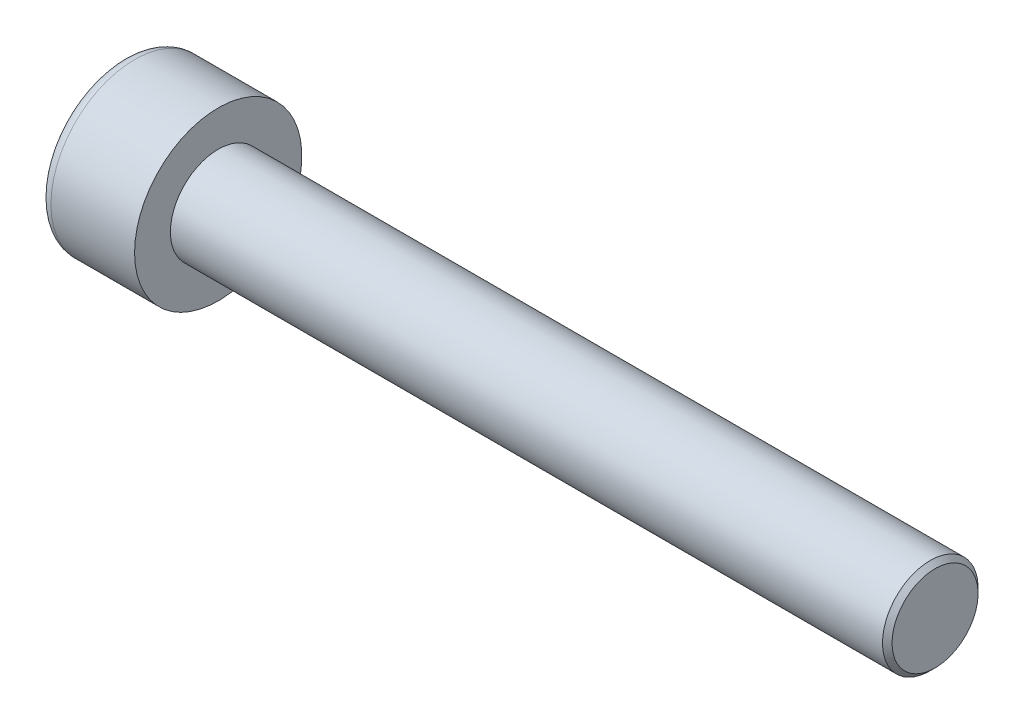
ISO-10303-21;
HEADER;
FILE_DESCRIPTION(('STEP AP214'),'2;1');
FILE_NAME('part.step','',(''),(''),'','','');
FILE_SCHEMA(('AUTOMOTIVE_DESIGN { 1 0 10303 214 1 1 1 1 }'));
ENDSEC;
DATA;
#1=APPLICATION_CONTEXT('core data for automotive mechanical design processes');
#2=APPLICATION_PROTOCOL_DEFINITION('international standard','automotive_design',2000,#1);
#3=PRODUCT_CONTEXT('',#1,'mechanical');
#4=PRODUCT('Part','Part','',(#3));
#5=PRODUCT_RELATED_PRODUCT_CATEGORY('part','',(#4));
#6=PRODUCT_DEFINITION_FORMATION('','',#4);
#7=PRODUCT_DEFINITION_CONTEXT('part definition',#1,'design');
#8=PRODUCT_DEFINITION('design','',#6,#7);
#9=PRODUCT_DEFINITION_SHAPE('','',#8);
#10=(LENGTH_UNIT() NAMED_UNIT(*) SI_UNIT(.MILLI.,.METRE.));
#11=(NAMED_UNIT(*) PLANE_ANGLE_UNIT() SI_UNIT($,.RADIAN.));
#12=(NAMED_UNIT(*) SI_UNIT($,.STERADIAN.) SOLID_ANGLE_UNIT());
#13=UNCERTAINTY_MEASURE_WITH_UNIT(LENGTH_MEASURE(1.E-05),#10,'distance_accuracy_value','');
#14=(GEOMETRIC_REPRESENTATION_CONTEXT(3) GLOBAL_UNCERTAINTY_ASSIGNED_CONTEXT((#13)) GLOBAL_UNIT_ASSIGNED_CONTEXT((#10,
#11,#12)) REPRESENTATION_CONTEXT('',''));
#15=CARTESIAN_POINT('',(0.,0.,0.));
#16=DIRECTION('',(0.,0.,1.));
#17=DIRECTION('',(1.,0.,0.));
#18=AXIS2_PLACEMENT_3D('',#15,#16,#17);
#19=CARTESIAN_POINT('',(2.,0.,-1.73205080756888));
#20=DIRECTION('',(1.,0.,0.));
#21=DIRECTION('',(0.,0.,-1.));
#22=AXIS2_PLACEMENT_3D('',#19,#20,#21);
#23=PLANE('',#22);
#24=DIRECTION('',(0.,0.866025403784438,0.5));
#25=VECTOR('',#24,1.);
#26=CARTESIAN_POINT('',(2.,0.,1.73205080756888));
#27=LINE('',#26,#25);
#28=CARTESIAN_POINT('',(2.,0.,1.73205080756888));
#29=VERTEX_POINT('',#28);
#30=CARTESIAN_POINT('',(2.00000000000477,-0.750000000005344,1.29903810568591));
#31=VERTEX_POINT('',#30);
#32=EDGE_CURVE('E121',#29,#31,#27,.F.);
#33=ORIENTED_EDGE('',*,*,#32,.F.);
#34=DIRECTION('',(0.,0.866025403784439,-0.5));
#35=VECTOR('',#34,1.);
#36=CARTESIAN_POINT('',(2.,1.5,0.866025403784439));
#37=LINE('',#36,#35);
#38=CARTESIAN_POINT('',(2.00000000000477,0.750000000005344,1.29903810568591));
#39=VERTEX_POINT('',#38);
#40=EDGE_CURVE('E120',#39,#29,#37,.F.);
#41=ORIENTED_EDGE('',*,*,#40,.F.);
#42=CARTESIAN_POINT('',(2.00000000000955,0.,0.));
#43=DIRECTION('',(-1.,0.,0.));
#44=DIRECTION('',(0.,0.,1.));
#45=AXIS2_PLACEMENT_3D('',#42,#43,#44);
#46=CIRCLE('',#45,1.50000000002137);
#47=EDGE_CURVE('E95',#39,#31,#46,.F.);
#48=ORIENTED_EDGE('',*,*,#47,.T.);
#49=EDGE_LOOP('',(#33,#41,#48));
#50=FACE_BOUND('',#49,.T.);
#51=ADVANCED_FACE('F17',(#50),#23,.F.);
#52=CARTESIAN_POINT('',(2.,0.,-1.73205080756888));
#53=DIRECTION('',(1.,0.,0.));
#54=DIRECTION('',(0.,0.,-1.));
#55=AXIS2_PLACEMENT_3D('',#52,#53,#54);
#56=PLANE('',#55);
#57=DIRECTION('',(0.,0.866025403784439,-0.5));
#58=VECTOR('',#57,1.);
#59=CARTESIAN_POINT('',(2.,1.5,0.866025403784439));
#60=LINE('',#59,#58);
#61=CARTESIAN_POINT('',(2.,1.5,0.866025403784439));
#62=VERTEX_POINT('',#61);
#63=EDGE_CURVE('E113',#62,#39,#60,.F.);
#64=ORIENTED_EDGE('',*,*,#63,.F.);
#65=DIRECTION('',(0.,0.,-1.));
#66=VECTOR('',#65,1.);
#67=CARTESIAN_POINT('',(2.,1.5,-0.866025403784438));
#68=LINE('',#67,#66);
#69=CARTESIAN_POINT('',(2.00000000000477,1.50000000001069,0.));
#70=VERTEX_POINT('',#69);
#71=EDGE_CURVE('E116',#70,#62,#68,.F.);
#72=ORIENTED_EDGE('',*,*,#71,.F.);
#73=CARTESIAN_POINT('',(2.00000000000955,0.,0.));
#74=DIRECTION('',(-1.,0.,0.));
#75=DIRECTION('',(0.,0.,1.));
#76=AXIS2_PLACEMENT_3D('',#73,#74,#75);
#77=CIRCLE('',#76,1.50000000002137);
#78=EDGE_CURVE('E99',#39,#70,#77,.T.);
#79=ORIENTED_EDGE('',*,*,#78,.F.);
#80=EDGE_LOOP('',(#64,#72,#79));
#81=FACE_BOUND('',#80,.T.);
#82=ADVANCED_FACE('F111',(#81),#56,.F.);
#83=CARTESIAN_POINT('',(2.,1.5,0.866025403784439));
#84=DIRECTION('',(0.,-0.5,-0.866025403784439));
#85=DIRECTION('',(0.,0.866025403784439,-0.5));
#86=AXIS2_PLACEMENT_3D('',#83,#84,#85);
#87=PLANE('',#86);
#88=ORIENTED_EDGE('',*,*,#40,.T.);
#89=DIRECTION('',(1.,0.,0.));
#90=VECTOR('',#89,1.);
#91=CARTESIAN_POINT('',(2.,0.,1.73205080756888));
#92=LINE('',#91,#90);
#93=CARTESIAN_POINT('',(0.,0.,1.73205080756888));
#94=VERTEX_POINT('',#93);
#95=EDGE_CURVE('E140',#94,#29,#92,.T.);
#96=ORIENTED_EDGE('',*,*,#95,.F.);
#97=DIRECTION('',(0.,0.866025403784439,-0.5));
#98=VECTOR('',#97,1.);
#99=CARTESIAN_POINT('',(0.,1.5,0.866025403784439));
#100=LINE('',#99,#98);
#101=CARTESIAN_POINT('',(0.,1.5,0.866025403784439));
#102=VERTEX_POINT('',#101);
#103=EDGE_CURVE('E118',#94,#102,#100,.T.);
#104=ORIENTED_EDGE('',*,*,#103,.T.);
#105=DIRECTION('',(1.,0.,0.));
#106=VECTOR('',#105,1.);
#107=CARTESIAN_POINT('',(2.,1.5,0.866025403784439));
#108=LINE('',#107,#106);
#109=EDGE_CURVE('E130',#62,#102,#108,.F.);
#110=ORIENTED_EDGE('',*,*,#109,.F.);
#111=ORIENTED_EDGE('',*,*,#63,.T.);
#112=EDGE_LOOP('',(#88,#96,#104,#110,#111));
#113=FACE_BOUND('',#112,.T.);
#114=ADVANCED_FACE('F127',(#113),#87,.T.);
#115=CARTESIAN_POINT('',(2.,0.,1.73205080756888));
#116=DIRECTION('',(0.,0.5,-0.866025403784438));
#117=DIRECTION('',(0.,0.866025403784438,0.5));
#118=AXIS2_PLACEMENT_3D('',#115,#116,#117);
#119=PLANE('',#118);
#120=DIRECTION('',(0.,-0.866025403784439,-0.5));
#121=VECTOR('',#120,1.);
#122=CARTESIAN_POINT('',(2.,-0.75,1.29903810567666));
#123=LINE('',#122,#121);
#124=CARTESIAN_POINT('',(2.,-1.5,0.866025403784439));
#125=VERTEX_POINT('',#124);
#126=EDGE_CURVE('E107',#31,#125,#123,.T.);
#127=ORIENTED_EDGE('',*,*,#126,.T.);
#128=DIRECTION('',(1.,0.,0.));
#129=VECTOR('',#128,1.);
#130=CARTESIAN_POINT('',(2.,-1.5,0.866025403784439));
#131=LINE('',#130,#129);
#132=CARTESIAN_POINT('',(0.,-1.5,0.866025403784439));
#133=VERTEX_POINT('',#132);
#134=EDGE_CURVE('E210',#133,#125,#131,.T.);
#135=ORIENTED_EDGE('',*,*,#134,.F.);
#136=DIRECTION('',(0.,0.866025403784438,0.5));
#137=VECTOR('',#136,1.);
#138=CARTESIAN_POINT('',(0.,0.,1.73205080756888));
#139=LINE('',#138,#137);
#140=EDGE_CURVE('E125',#133,#94,#139,.T.);
#141=ORIENTED_EDGE('',*,*,#140,.T.);
#142=ORIENTED_EDGE('',*,*,#95,.T.);
#143=ORIENTED_EDGE('',*,*,#32,.T.);
#144=EDGE_LOOP('',(#127,#135,#141,#142,#143));
#145=FACE_BOUND('',#144,.T.);
#146=ADVANCED_FACE('F428',(#145),#119,.T.);
#147=CARTESIAN_POINT('',(2.,0.,-1.73205080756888));
#148=DIRECTION('',(1.,0.,0.));
#149=DIRECTION('',(0.,0.,-1.));
#150=AXIS2_PLACEMENT_3D('',#147,#148,#149);
#151=PLANE('',#150);
#152=DIRECTION('',(0.,0.,1.));
#153=VECTOR('',#152,1.);
#154=CARTESIAN_POINT('',(2.,-1.5,0.866025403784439));
#155=LINE('',#154,#153);
#156=CARTESIAN_POINT('',(2.00000000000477,-1.50000000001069,0.));
#157=VERTEX_POINT('',#156);
#158=EDGE_CURVE('E207',#125,#157,#155,.F.);
#159=ORIENTED_EDGE('',*,*,#158,.F.);
#160=ORIENTED_EDGE('',*,*,#126,.F.);
#161=CARTESIAN_POINT('',(2.00000000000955,0.,0.));
#162=DIRECTION('',(-1.,0.,0.));
#163=DIRECTION('',(0.,0.,1.));
#164=AXIS2_PLACEMENT_3D('',#161,#162,#163);
#165=CIRCLE('',#164,1.50000000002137);
#166=EDGE_CURVE('E102',#31,#157,#165,.F.);
#167=ORIENTED_EDGE('',*,*,#166,.T.);
#168=EDGE_LOOP('',(#159,#160,#167));
#169=FACE_BOUND('',#168,.T.);
#170=ADVANCED_FACE('F418',(#169),#151,.F.);
#171=CARTESIAN_POINT('',(2.00000000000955,0.,0.));
#172=DIRECTION('',(-1.,0.,0.));
#173=DIRECTION('',(0.,0.,1.));
#174=AXIS2_PLACEMENT_3D('',#171,#172,#173);
#175=CONICAL_SURFACE('',#174,1.50000000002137,1.04719755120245);
#176=CARTESIAN_POINT('',(2.86602540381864,0.,0.));
#177=VERTEX_POINT('',#176);
#178=VERTEX_LOOP('',#177);
#179=FACE_BOUND('',#178,.T.);
#180=CARTESIAN_POINT('',(2.00000000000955,0.,0.));
#181=DIRECTION('',(-1.,0.,0.));
#182=DIRECTION('',(0.,0.,1.));
#183=AXIS2_PLACEMENT_3D('',#180,#181,#182);
#184=CIRCLE('',#183,1.50000000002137);
#185=CARTESIAN_POINT('',(2.00000000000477,0.750000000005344,-1.29903810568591));
#186=VERTEX_POINT('',#185);
#187=EDGE_CURVE('E154',#70,#186,#184,.T.);
#188=ORIENTED_EDGE('',*,*,#187,.T.);
#189=CARTESIAN_POINT('',(2.00000000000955,0.,0.));
#190=DIRECTION('',(-1.,0.,0.));
#191=DIRECTION('',(0.,0.,1.));
#192=AXIS2_PLACEMENT_3D('',#189,#190,#191);
#193=CIRCLE('',#192,1.50000000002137);
#194=CARTESIAN_POINT('',(2.00000000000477,-0.750000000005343,-1.29903810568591));
#195=VERTEX_POINT('',#194);
#196=EDGE_CURVE('E169',#195,#186,#193,.F.);
#197=ORIENTED_EDGE('',*,*,#196,.F.);
#198=CARTESIAN_POINT('',(2.00000000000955,0.,0.));
#199=DIRECTION('',(-1.,0.,0.));
#200=DIRECTION('',(0.,0.,1.));
#201=AXIS2_PLACEMENT_3D('',#198,#199,#200);
#202=CIRCLE('',#201,1.50000000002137);
#203=EDGE_CURVE('E164',#195,#157,#202,.T.);
#204=ORIENTED_EDGE('',*,*,#203,.T.);
#205=ORIENTED_EDGE('',*,*,#166,.F.);
#206=ORIENTED_EDGE('',*,*,#47,.F.);
#207=ORIENTED_EDGE('',*,*,#78,.T.);
#208=EDGE_LOOP('',(#188,#197,#204,#205,#206,#207));
#209=FACE_BOUND('',#208,.T.);
#210=ADVANCED_FACE('F98',(#179,#209),#175,.F.);
#211=CARTESIAN_POINT('',(2.,0.,-1.73205080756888));
#212=DIRECTION('',(1.,0.,0.));
#213=DIRECTION('',(0.,0.,-1.));
#214=AXIS2_PLACEMENT_3D('',#211,#212,#213);
#215=PLANE('',#214);
#216=DIRECTION('',(0.,0.,-1.));
#217=VECTOR('',#216,1.);
#218=CARTESIAN_POINT('',(2.,1.5,-0.866025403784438));
#219=LINE('',#218,#217);
#220=CARTESIAN_POINT('',(2.,1.5,-0.866025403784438));
#221=VERTEX_POINT('',#220);
#222=EDGE_CURVE('E153',#221,#70,#219,.F.);
#223=ORIENTED_EDGE('',*,*,#222,.F.);
#224=DIRECTION('',(0.,-0.866025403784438,-0.5));
#225=VECTOR('',#224,1.);
#226=CARTESIAN_POINT('',(2.,0.,-1.73205080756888));
#227=LINE('',#226,#225);
#228=EDGE_CURVE('E192',#186,#221,#227,.F.);
#229=ORIENTED_EDGE('',*,*,#228,.F.);
#230=ORIENTED_EDGE('',*,*,#187,.F.);
#231=EDGE_LOOP('',(#223,#229,#230));
#232=FACE_BOUND('',#231,.T.);
#233=ADVANCED_FACE('F400',(#232),#215,.F.);
#234=CARTESIAN_POINT('',(2.,1.5,-0.866025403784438));
#235=DIRECTION('',(0.,-1.,0.));
#236=DIRECTION('',(0.,0.,-1.));
#237=AXIS2_PLACEMENT_3D('',#234,#235,#236);
#238=PLANE('',#237);
#239=ORIENTED_EDGE('',*,*,#71,.T.);
#240=ORIENTED_EDGE('',*,*,#109,.T.);
#241=DIRECTION('',(0.,0.,-1.));
#242=VECTOR('',#241,1.);
#243=CARTESIAN_POINT('',(0.,1.5,-0.866025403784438));
#244=LINE('',#243,#242);
#245=CARTESIAN_POINT('',(0.,1.5,-0.866025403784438));
#246=VERTEX_POINT('',#245);
#247=EDGE_CURVE('E150',#102,#246,#244,.T.);
#248=ORIENTED_EDGE('',*,*,#247,.T.);
#249=DIRECTION('',(1.,0.,0.));
#250=VECTOR('',#249,1.);
#251=CARTESIAN_POINT('',(2.,1.5,-0.866025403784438));
#252=LINE('',#251,#250);
#253=EDGE_CURVE('E195',#221,#246,#252,.F.);
#254=ORIENTED_EDGE('',*,*,#253,.F.);
#255=ORIENTED_EDGE('',*,*,#222,.T.);
#256=EDGE_LOOP('',(#239,#240,#248,#254,#255));
#257=FACE_BOUND('',#256,.T.);
#258=ADVANCED_FACE('F391',(#257),#238,.T.);
#259=CARTESIAN_POINT('',(2.,-1.5,0.866025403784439));
#260=DIRECTION('',(0.,1.,0.));
#261=DIRECTION('',(0.,0.,1.));
#262=AXIS2_PLACEMENT_3D('',#259,#260,#261);
#263=PLANE('',#262);
#264=DIRECTION('',(0.,0.,-1.));
#265=VECTOR('',#264,1.);
#266=CARTESIAN_POINT('',(2.,-1.5,-1.73205080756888));
#267=LINE('',#266,#265);
#268=CARTESIAN_POINT('',(2.,-1.5,-0.866025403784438));
#269=VERTEX_POINT('',#268);
#270=EDGE_CURVE('E167',#157,#269,#267,.T.);
#271=ORIENTED_EDGE('',*,*,#270,.T.);
#272=DIRECTION('',(1.,0.,0.));
#273=VECTOR('',#272,1.);
#274=CARTESIAN_POINT('',(2.,-1.5,-0.866025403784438));
#275=LINE('',#274,#273);
#276=CARTESIAN_POINT('',(0.,-1.5,-0.866025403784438));
#277=VERTEX_POINT('',#276);
#278=EDGE_CURVE('E201',#277,#269,#275,.T.);
#279=ORIENTED_EDGE('',*,*,#278,.F.);
#280=DIRECTION('',(0.,0.,1.));
#281=VECTOR('',#280,1.);
#282=CARTESIAN_POINT('',(0.,-1.5,0.866025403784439));
#283=LINE('',#282,#281);
#284=EDGE_CURVE('E218',#277,#133,#283,.T.);
#285=ORIENTED_EDGE('',*,*,#284,.T.);
#286=ORIENTED_EDGE('',*,*,#134,.T.);
#287=ORIENTED_EDGE('',*,*,#158,.T.);
#288=EDGE_LOOP('',(#271,#279,#285,#286,#287));
#289=FACE_BOUND('',#288,.T.);
#290=ADVANCED_FACE('F381',(#289),#263,.T.);
#291=CARTESIAN_POINT('',(2.,0.,-1.73205080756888));
#292=DIRECTION('',(1.,0.,0.));
#293=DIRECTION('',(0.,0.,-1.));
#294=AXIS2_PLACEMENT_3D('',#291,#292,#293);
#295=PLANE('',#294);
#296=DIRECTION('',(0.,-0.866025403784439,0.5));
#297=VECTOR('',#296,1.);
#298=CARTESIAN_POINT('',(2.,-1.5,-0.866025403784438));
#299=LINE('',#298,#297);
#300=EDGE_CURVE('E235',#269,#195,#299,.F.);
#301=ORIENTED_EDGE('',*,*,#300,.F.);
#302=ORIENTED_EDGE('',*,*,#270,.F.);
#303=ORIENTED_EDGE('',*,*,#203,.F.);
#304=EDGE_LOOP('',(#301,#302,#303));
#305=FACE_BOUND('',#304,.T.);
#306=ADVANCED_FACE('F371',(#305),#295,.F.);
#307=CARTESIAN_POINT('',(2.,0.,-1.73205080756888));
#308=DIRECTION('',(1.,0.,0.));
#309=DIRECTION('',(0.,0.,-1.));
#310=AXIS2_PLACEMENT_3D('',#307,#308,#309);
#311=PLANE('',#310);
#312=DIRECTION('',(0.,-0.866025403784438,-0.5));
#313=VECTOR('',#312,1.);
#314=CARTESIAN_POINT('',(2.,0.,-1.73205080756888));
#315=LINE('',#314,#313);
#316=CARTESIAN_POINT('',(2.,0.,-1.73205080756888));
#317=VERTEX_POINT('',#316);
#318=EDGE_CURVE('E196',#317,#186,#315,.F.);
#319=ORIENTED_EDGE('',*,*,#318,.F.);
#320=DIRECTION('',(0.,-0.866025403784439,0.5));
#321=VECTOR('',#320,1.);
#322=CARTESIAN_POINT('',(2.,-1.5,-0.866025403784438));
#323=LINE('',#322,#321);
#324=EDGE_CURVE('E184',#195,#317,#323,.F.);
#325=ORIENTED_EDGE('',*,*,#324,.F.);
#326=ORIENTED_EDGE('',*,*,#196,.T.);
#327=EDGE_LOOP('',(#319,#325,#326));
#328=FACE_BOUND('',#327,.T.);
#329=ADVANCED_FACE('F361',(#328),#311,.F.);
#330=CARTESIAN_POINT('',(2.,0.,-1.73205080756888));
#331=DIRECTION('',(0.,-0.5,0.866025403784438));
#332=DIRECTION('',(0.,-0.866025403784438,-0.5));
#333=AXIS2_PLACEMENT_3D('',#330,#331,#332);
#334=PLANE('',#333);
#335=ORIENTED_EDGE('',*,*,#228,.T.);
#336=ORIENTED_EDGE('',*,*,#253,.T.);
#337=DIRECTION('',(0.,-0.866025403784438,-0.5));
#338=VECTOR('',#337,1.);
#339=CARTESIAN_POINT('',(0.,0.,-1.73205080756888));
#340=LINE('',#339,#338);
#341=CARTESIAN_POINT('',(0.,0.,-1.73205080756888));
#342=VERTEX_POINT('',#341);
#343=EDGE_CURVE('E166',#246,#342,#340,.T.);
#344=ORIENTED_EDGE('',*,*,#343,.T.);
#345=DIRECTION('',(1.,0.,0.));
#346=VECTOR('',#345,1.);
#347=CARTESIAN_POINT('',(2.,0.,-1.73205080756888));
#348=LINE('',#347,#346);
#349=EDGE_CURVE('E178',#317,#342,#348,.F.);
#350=ORIENTED_EDGE('',*,*,#349,.F.);
#351=ORIENTED_EDGE('',*,*,#318,.T.);
#352=EDGE_LOOP('',(#335,#336,#344,#350,#351));
#353=FACE_BOUND('',#352,.T.);
#354=ADVANCED_FACE('F301',(#353),#334,.T.);
#355=CARTESIAN_POINT('',(2.,-1.5,-0.866025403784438));
#356=DIRECTION('',(0.,0.5,0.866025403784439));
#357=DIRECTION('',(0.,-0.866025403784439,0.5));
#358=AXIS2_PLACEMENT_3D('',#355,#356,#357);
#359=PLANE('',#358);
#360=ORIENTED_EDGE('',*,*,#324,.T.);
#361=ORIENTED_EDGE('',*,*,#349,.T.);
#362=DIRECTION('',(0.,-0.866025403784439,0.5));
#363=VECTOR('',#362,1.);
#364=CARTESIAN_POINT('',(0.,0.,-1.73205080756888));
#365=LINE('',#364,#363);
#366=EDGE_CURVE('E176',#342,#277,#365,.T.);
#367=ORIENTED_EDGE('',*,*,#366,.T.);
#368=ORIENTED_EDGE('',*,*,#278,.T.);
#369=ORIENTED_EDGE('',*,*,#300,.T.);
#370=EDGE_LOOP('',(#360,#361,#367,#368,#369));
#371=FACE_BOUND('',#370,.T.);
#372=ADVANCED_FACE('F295',(#371),#359,.T.);
#373=CARTESIAN_POINT('',(0.,0.,0.));
#374=DIRECTION('',(1.,0.,0.));
#375=DIRECTION('',(0.,0.,-1.));
#376=AXIS2_PLACEMENT_3D('',#373,#374,#375);
#377=PLANE('',#376);
#378=ORIENTED_EDGE('',*,*,#343,.F.);
#379=ORIENTED_EDGE('',*,*,#247,.F.);
#380=ORIENTED_EDGE('',*,*,#103,.F.);
#381=ORIENTED_EDGE('',*,*,#140,.F.);
#382=ORIENTED_EDGE('',*,*,#284,.F.);
#383=ORIENTED_EDGE('',*,*,#366,.F.);
#384=EDGE_LOOP('',(#378,#379,#380,#381,#382,#383));
#385=FACE_BOUND('',#384,.T.);
#386=CARTESIAN_POINT('',(0.,0.,0.));
#387=DIRECTION('',(1.,0.,0.));
#388=DIRECTION('',(0.,0.,-1.));
#389=AXIS2_PLACEMENT_3D('',#386,#387,#388);
#390=CIRCLE('',#389,3.);
#391=CARTESIAN_POINT('',(0.,0.,-3.));
#392=VERTEX_POINT('',#391);
#393=CARTESIAN_POINT('',(0.,0.,3.));
#394=VERTEX_POINT('',#393);
#395=EDGE_CURVE('E174',#392,#394,#390,.T.);
#396=ORIENTED_EDGE('',*,*,#395,.F.);
#397=CARTESIAN_POINT('',(0.,0.,0.));
#398=DIRECTION('',(1.,0.,0.));
#399=DIRECTION('',(0.,0.,1.));
#400=AXIS2_PLACEMENT_3D('',#397,#398,#399);
#401=CIRCLE('',#400,3.);
#402=EDGE_CURVE('E36',#394,#392,#401,.T.);
#403=ORIENTED_EDGE('',*,*,#402,.F.);
#404=EDGE_LOOP('',(#396,#403));
#405=FACE_BOUND('',#404,.T.);
#406=ADVANCED_FACE('F269',(#385,#405),#377,.F.);
#407=CARTESIAN_POINT('',(0.5,0.,0.));
#408=DIRECTION('',(1.,0.,0.));
#409=DIRECTION('',(0.,0.,-1.));
#410=AXIS2_PLACEMENT_3D('',#407,#408,#409);
#411=TOROIDAL_SURFACE('',#410,3.,0.5);
#412=CARTESIAN_POINT('',(0.5,0.,0.));
#413=DIRECTION('',(-1.,0.,0.));
#414=DIRECTION('',(0.,0.,1.));
#415=AXIS2_PLACEMENT_3D('',#412,#413,#414);
#416=CIRCLE('',#415,3.5);
#417=CARTESIAN_POINT('',(0.5,0.,3.5));
#418=VERTEX_POINT('',#417);
#419=EDGE_CURVE('E163',#418,#418,#416,.F.);
#420=ORIENTED_EDGE('',*,*,#419,.F.);
#421=EDGE_LOOP('',(#420));
#422=FACE_BOUND('',#421,.T.);
#423=ORIENTED_EDGE('',*,*,#395,.T.);
#424=ORIENTED_EDGE('',*,*,#402,.T.);
#425=EDGE_LOOP('',(#423,#424));
#426=FACE_BOUND('',#425,.T.);
#427=ADVANCED_FACE('F173',(#422,#426),#411,.T.);
#428=CARTESIAN_POINT('',(34.,0.,0.));
#429=DIRECTION('',(1.,0.,0.));
#430=DIRECTION('',(0.,0.,-1.));
#431=AXIS2_PLACEMENT_3D('',#428,#429,#430);
#432=PLANE('',#431);
#433=CARTESIAN_POINT('',(34.0000000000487,0.,0.));
#434=DIRECTION('',(-1.,0.,0.));
#435=DIRECTION('',(0.,0.,1.));
#436=AXIS2_PLACEMENT_3D('',#433,#434,#435);
#437=CIRCLE('',#436,1.80000000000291);
#438=CARTESIAN_POINT('',(34.0000000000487,0.,1.80000000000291));
#439=VERTEX_POINT('',#438);
#440=EDGE_CURVE('E160',#439,#439,#437,.T.);
#441=ORIENTED_EDGE('',*,*,#440,.F.);
#442=EDGE_LOOP('',(#441));
#443=FACE_BOUND('',#442,.T.);
#444=ADVANCED_FACE('F268',(#443),#432,.T.);
#445=CARTESIAN_POINT('',(4.,0.,0.));
#446=DIRECTION('',(-1.,0.,0.));
#447=DIRECTION('',(0.,0.,1.));
#448=AXIS2_PLACEMENT_3D('',#445,#446,#447);
#449=CYLINDRICAL_SURFACE('',#448,3.5);
#450=ORIENTED_EDGE('',*,*,#419,.T.);
#451=EDGE_LOOP('',(#450));
#452=FACE_BOUND('',#451,.T.);
#453=CARTESIAN_POINT('',(4.,0.,0.));
#454=DIRECTION('',(-1.,0.,0.));
#455=DIRECTION('',(0.,0.,1.));
#456=AXIS2_PLACEMENT_3D('',#453,#454,#455);
#457=CIRCLE('',#456,3.5);
#458=CARTESIAN_POINT('',(4.,0.,3.5));
#459=VERTEX_POINT('',#458);
#460=EDGE_CURVE('E157',#459,#459,#457,.F.);
#461=ORIENTED_EDGE('',*,*,#460,.F.);
#462=EDGE_LOOP('',(#461));
#463=FACE_BOUND('',#462,.T.);
#464=ADVANCED_FACE('F316',(#452,#463),#449,.T.);
#465=CARTESIAN_POINT('',(33.8000000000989,0.,0.));
#466=DIRECTION('',(-1.,0.,0.));
#467=DIRECTION('',(0.,0.,1.));
#468=AXIS2_PLACEMENT_3D('',#465,#466,#467);
#469=CONICAL_SURFACE('',#468,1.99999999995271,0.785398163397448);
#470=CARTESIAN_POINT('',(33.8,0.,0.));
#471=DIRECTION('',(-1.,0.,0.));
#472=DIRECTION('',(0.,0.,1.));
#473=AXIS2_PLACEMENT_3D('',#470,#471,#472);
#474=CIRCLE('',#473,2.);
#475=CARTESIAN_POINT('',(33.8,0.,2.));
#476=VERTEX_POINT('',#475);
#477=EDGE_CURVE('E28',#476,#476,#474,.T.);
#478=ORIENTED_EDGE('',*,*,#477,.F.);
#479=EDGE_LOOP('',(#478));
#480=FACE_BOUND('',#479,.T.);
#481=ORIENTED_EDGE('',*,*,#440,.T.);
#482=EDGE_LOOP('',(#481));
#483=FACE_BOUND('',#482,.T.);
#484=ADVANCED_FACE('F310',(#480,#483),#469,.T.);
#485=CARTESIAN_POINT('',(4.,0.,0.));
#486=DIRECTION('',(1.,0.,0.));
#487=DIRECTION('',(0.,0.,-1.));
#488=AXIS2_PLACEMENT_3D('',#485,#486,#487);
#489=PLANE('',#488);
#490=CARTESIAN_POINT('',(4.,0.,0.));
#491=DIRECTION('',(-1.,0.,0.));
#492=DIRECTION('',(0.,0.,1.));
#493=AXIS2_PLACEMENT_3D('',#490,#491,#492);
#494=CIRCLE('',#493,2.);
#495=CARTESIAN_POINT('',(4.,0.,2.));
#496=VERTEX_POINT('',#495);
#497=EDGE_CURVE('E11',#496,#496,#494,.F.);
#498=ORIENTED_EDGE('',*,*,#497,.F.);
#499=EDGE_LOOP('',(#498));
#500=FACE_BOUND('',#499,.T.);
#501=ORIENTED_EDGE('',*,*,#460,.T.);
#502=EDGE_LOOP('',(#501));
#503=FACE_BOUND('',#502,.T.);
#504=ADVANCED_FACE('F304',(#500,#503),#489,.T.);
#505=CARTESIAN_POINT('',(34.,0.,0.));
#506=DIRECTION('',(-1.,0.,0.));
#507=DIRECTION('',(0.,0.,1.));
#508=AXIS2_PLACEMENT_3D('',#505,#506,#507);
#509=CYLINDRICAL_SURFACE('',#508,2.);
#510=ORIENTED_EDGE('',*,*,#497,.T.);
#511=EDGE_LOOP('',(#510));
#512=FACE_BOUND('',#511,.T.);
#513=ORIENTED_EDGE('',*,*,#477,.T.);
#514=EDGE_LOOP('',(#513));
#515=FACE_BOUND('',#514,.T.);
#516=ADVANCED_FACE('F302',(#512,#515),#509,.T.);
#517=CLOSED_SHELL('',(#51,#82,#114,#146,#170,#210,#233,#258,#290,#306,#329,#354,#372,#406,#427,
#444,#464,#484,#504,#516));
#518=MANIFOLD_SOLID_BREP('B1',#517);
#519=ADVANCED_BREP_SHAPE_REPRESENTATION('',(#18,#518),#14);
#520=SHAPE_DEFINITION_REPRESENTATION(#9,#519);
ENDSEC;
END-ISO-10303-21;
